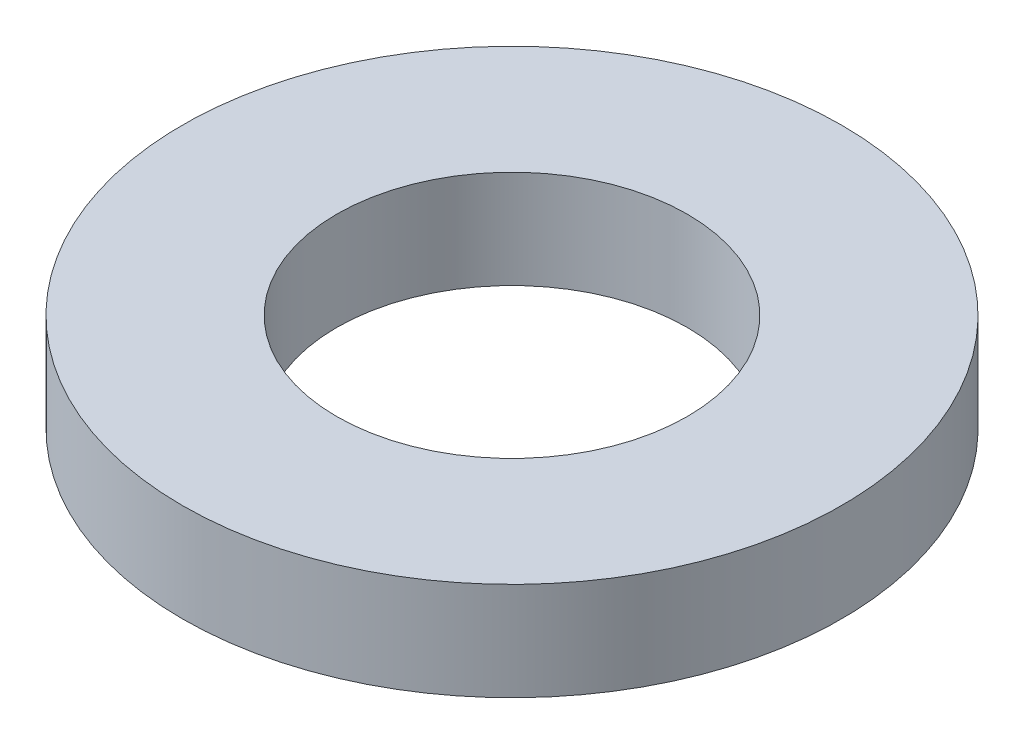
ISO-10303-21;
HEADER;
FILE_DESCRIPTION(('STEP AP214'),'2;1');
FILE_NAME('part.step','',(''),(''),'','','');
FILE_SCHEMA(('AUTOMOTIVE_DESIGN { 1 0 10303 214 1 1 1 1 }'));
ENDSEC;
DATA;
#1=APPLICATION_CONTEXT('core data for automotive mechanical design processes');
#2=APPLICATION_PROTOCOL_DEFINITION('international standard','automotive_design',2000,#1);
#3=PRODUCT_CONTEXT('',#1,'mechanical');
#4=PRODUCT('Part','Part','',(#3));
#5=PRODUCT_RELATED_PRODUCT_CATEGORY('part','',(#4));
#6=PRODUCT_DEFINITION_FORMATION('','',#4);
#7=PRODUCT_DEFINITION_CONTEXT('part definition',#1,'design');
#8=PRODUCT_DEFINITION('design','',#6,#7);
#9=PRODUCT_DEFINITION_SHAPE('','',#8);
#10=(LENGTH_UNIT() NAMED_UNIT(*) SI_UNIT(.MILLI.,.METRE.));
#11=(NAMED_UNIT(*) PLANE_ANGLE_UNIT() SI_UNIT($,.RADIAN.));
#12=(NAMED_UNIT(*) SI_UNIT($,.STERADIAN.) SOLID_ANGLE_UNIT());
#13=UNCERTAINTY_MEASURE_WITH_UNIT(LENGTH_MEASURE(1.E-05),#10,'distance_accuracy_value','');
#14=(GEOMETRIC_REPRESENTATION_CONTEXT(3) GLOBAL_UNCERTAINTY_ASSIGNED_CONTEXT((#13)) GLOBAL_UNIT_ASSIGNED_CONTEXT((#10,
#11,#12)) REPRESENTATION_CONTEXT('',''));
#15=CARTESIAN_POINT('',(0.,0.,0.));
#16=DIRECTION('',(0.,0.,1.));
#17=DIRECTION('',(1.,0.,0.));
#18=AXIS2_PLACEMENT_3D('',#15,#16,#17);
#19=CARTESIAN_POINT('',(0.,-7.,0.));
#20=DIRECTION('',(0.,1.,0.));
#21=DIRECTION('',(0.,0.,1.));
#22=AXIS2_PLACEMENT_3D('',#19,#20,#21);
#23=CYLINDRICAL_SURFACE('',#22,23.5);
#24=CARTESIAN_POINT('',(0.,-7.,0.));
#25=DIRECTION('',(0.,1.,0.));
#26=DIRECTION('',(0.,0.,1.));
#27=AXIS2_PLACEMENT_3D('',#24,#25,#26);
#28=CIRCLE('',#27,23.5);
#29=CARTESIAN_POINT('',(0.,-7.,23.5));
#30=VERTEX_POINT('',#29);
#31=EDGE_CURVE('E10',#30,#30,#28,.T.);
#32=ORIENTED_EDGE('',*,*,#31,.T.);
#33=EDGE_LOOP('',(#32));
#34=FACE_BOUND('',#33,.T.);
#35=CARTESIAN_POINT('',(0.,0.,0.));
#36=DIRECTION('',(0.,1.,0.));
#37=DIRECTION('',(0.,0.,1.));
#38=AXIS2_PLACEMENT_3D('',#35,#36,#37);
#39=CIRCLE('',#38,23.5);
#40=CARTESIAN_POINT('',(0.,0.,23.5));
#41=VERTEX_POINT('',#40);
#42=EDGE_CURVE('E33',#41,#41,#39,.T.);
#43=ORIENTED_EDGE('',*,*,#42,.F.);
#44=EDGE_LOOP('',(#43));
#45=FACE_BOUND('',#44,.T.);
#46=ADVANCED_FACE('F30',(#34,#45),#23,.T.);
#47=CARTESIAN_POINT('',(0.,-7.,0.));
#48=DIRECTION('',(0.,1.,0.));
#49=DIRECTION('',(0.,0.,1.));
#50=AXIS2_PLACEMENT_3D('',#47,#48,#49);
#51=PLANE('',#50);
#52=CARTESIAN_POINT('',(0.,-7.,0.));
#53=DIRECTION('',(0.,1.,0.));
#54=DIRECTION('',(0.,0.,1.));
#55=AXIS2_PLACEMENT_3D('',#52,#53,#54);
#56=CIRCLE('',#55,12.5);
#57=CARTESIAN_POINT('',(0.,-7.,12.5));
#58=VERTEX_POINT('',#57);
#59=EDGE_CURVE('E40',#58,#58,#56,.T.);
#60=ORIENTED_EDGE('',*,*,#59,.T.);
#61=EDGE_LOOP('',(#60));
#62=FACE_BOUND('',#61,.T.);
#63=ORIENTED_EDGE('',*,*,#31,.F.);
#64=EDGE_LOOP('',(#63));
#65=FACE_BOUND('',#64,.T.);
#66=ADVANCED_FACE('F48',(#62,#65),#51,.F.);
#67=CARTESIAN_POINT('',(0.,0.,0.));
#68=DIRECTION('',(0.,1.,0.));
#69=DIRECTION('',(0.,0.,1.));
#70=AXIS2_PLACEMENT_3D('',#67,#68,#69);
#71=PLANE('',#70);
#72=CARTESIAN_POINT('',(0.,0.,0.));
#73=DIRECTION('',(0.,1.,0.));
#74=DIRECTION('',(0.,0.,1.));
#75=AXIS2_PLACEMENT_3D('',#72,#73,#74);
#76=CIRCLE('',#75,12.5);
#77=CARTESIAN_POINT('',(0.,0.,12.5));
#78=VERTEX_POINT('',#77);
#79=EDGE_CURVE('E42',#78,#78,#76,.T.);
#80=ORIENTED_EDGE('',*,*,#79,.F.);
#81=EDGE_LOOP('',(#80));
#82=FACE_BOUND('',#81,.T.);
#83=ORIENTED_EDGE('',*,*,#42,.T.);
#84=EDGE_LOOP('',(#83));
#85=FACE_BOUND('',#84,.T.);
#86=ADVANCED_FACE('F54',(#82,#85),#71,.T.);
#87=CARTESIAN_POINT('',(0.,-7.,0.));
#88=DIRECTION('',(0.,1.,0.));
#89=DIRECTION('',(0.,0.,1.));
#90=AXIS2_PLACEMENT_3D('',#87,#88,#89);
#91=CYLINDRICAL_SURFACE('',#90,12.5);
#92=ORIENTED_EDGE('',*,*,#59,.F.);
#93=EDGE_LOOP('',(#92));
#94=FACE_BOUND('',#93,.T.);
#95=ORIENTED_EDGE('',*,*,#79,.T.);
#96=EDGE_LOOP('',(#95));
#97=FACE_BOUND('',#96,.T.);
#98=ADVANCED_FACE('F51',(#94,#97),#91,.F.);
#99=CLOSED_SHELL('',(#46,#66,#86,#98));
#100=MANIFOLD_SOLID_BREP('B2',#99);
#101=ADVANCED_BREP_SHAPE_REPRESENTATION('',(#18,#100),#14);
#102=SHAPE_DEFINITION_REPRESENTATION(#9,#101);
ENDSEC;
END-ISO-10303-21;
